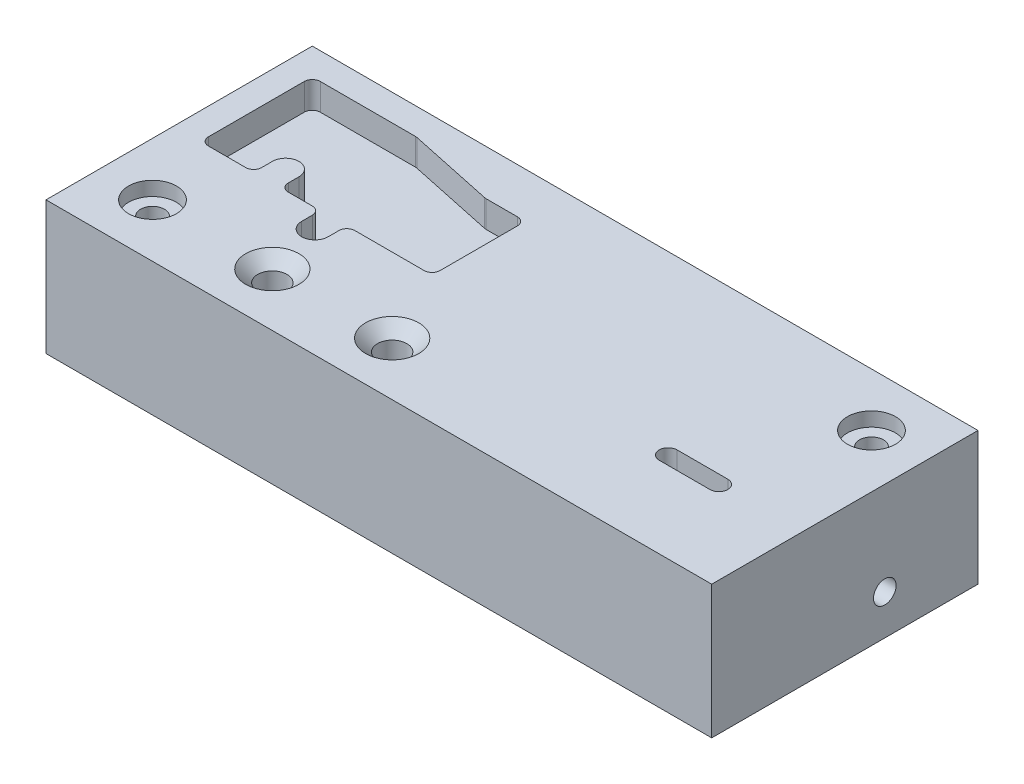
ISO-10303-21;
HEADER;
FILE_DESCRIPTION(('STEP AP214'),'2;1');
FILE_NAME('part.step','',(''),(''),'','','');
FILE_SCHEMA(('AUTOMOTIVE_DESIGN { 1 0 10303 214 1 1 1 1 }'));
ENDSEC;
DATA;
#1=APPLICATION_CONTEXT('core data for automotive mechanical design processes');
#2=APPLICATION_PROTOCOL_DEFINITION('international standard','automotive_design',2000,#1);
#3=PRODUCT_CONTEXT('',#1,'mechanical');
#4=PRODUCT('Part','Part','',(#3));
#5=PRODUCT_RELATED_PRODUCT_CATEGORY('part','',(#4));
#6=PRODUCT_DEFINITION_FORMATION('','',#4);
#7=PRODUCT_DEFINITION_CONTEXT('part definition',#1,'design');
#8=PRODUCT_DEFINITION('design','',#6,#7);
#9=PRODUCT_DEFINITION_SHAPE('','',#8);
#10=(LENGTH_UNIT() NAMED_UNIT(*) SI_UNIT(.MILLI.,.METRE.));
#11=(NAMED_UNIT(*) PLANE_ANGLE_UNIT() SI_UNIT($,.RADIAN.));
#12=(NAMED_UNIT(*) SI_UNIT($,.STERADIAN.) SOLID_ANGLE_UNIT());
#13=UNCERTAINTY_MEASURE_WITH_UNIT(LENGTH_MEASURE(1.E-05),#10,'distance_accuracy_value','');
#14=(GEOMETRIC_REPRESENTATION_CONTEXT(3) GLOBAL_UNCERTAINTY_ASSIGNED_CONTEXT((#13)) GLOBAL_UNIT_ASSIGNED_CONTEXT((#10,
#11,#12)) REPRESENTATION_CONTEXT('',''));
#15=CARTESIAN_POINT('',(0.,0.,0.));
#16=DIRECTION('',(0.,0.,1.));
#17=DIRECTION('',(1.,0.,0.));
#18=AXIS2_PLACEMENT_3D('',#15,#16,#17);
#19=CARTESIAN_POINT('',(-125.,50.,-50.));
#20=DIRECTION('',(1.,0.,0.));
#21=DIRECTION('',(0.,0.,-1.));
#22=AXIS2_PLACEMENT_3D('',#19,#20,#21);
#23=PLANE('',#22);
#24=DIRECTION('',(0.,0.,1.));
#25=VECTOR('',#24,1.);
#26=CARTESIAN_POINT('',(-125.,0.,-50.));
#27=LINE('',#26,#25);
#28=CARTESIAN_POINT('',(-125.,0.,-50.));
#29=VERTEX_POINT('',#28);
#30=CARTESIAN_POINT('',(-125.,0.,50.));
#31=VERTEX_POINT('',#30);
#32=EDGE_CURVE('E521',#29,#31,#27,.T.);
#33=ORIENTED_EDGE('',*,*,#32,.T.);
#34=DIRECTION('',(0.,-1.,0.));
#35=VECTOR('',#34,1.);
#36=CARTESIAN_POINT('',(-125.,50.,50.));
#37=LINE('',#36,#35);
#38=CARTESIAN_POINT('',(-125.,50.,50.));
#39=VERTEX_POINT('',#38);
#40=EDGE_CURVE('E11',#39,#31,#37,.T.);
#41=ORIENTED_EDGE('',*,*,#40,.F.);
#42=DIRECTION('',(0.,0.,1.));
#43=VECTOR('',#42,1.);
#44=CARTESIAN_POINT('',(-125.,50.,-50.));
#45=LINE('',#44,#43);
#46=CARTESIAN_POINT('',(-125.,50.,-50.));
#47=VERTEX_POINT('',#46);
#48=EDGE_CURVE('E522',#47,#39,#45,.T.);
#49=ORIENTED_EDGE('',*,*,#48,.F.);
#50=DIRECTION('',(0.,-1.,0.));
#51=VECTOR('',#50,1.);
#52=CARTESIAN_POINT('',(-125.,50.,-50.));
#53=LINE('',#52,#51);
#54=EDGE_CURVE('E532',#47,#29,#53,.T.);
#55=ORIENTED_EDGE('',*,*,#54,.T.);
#56=EDGE_LOOP('',(#33,#41,#49,#55));
#57=FACE_BOUND('',#56,.T.);
#58=ADVANCED_FACE('F36',(#57),#23,.F.);
#59=CARTESIAN_POINT('',(-125.,50.,50.));
#60=DIRECTION('',(0.,0.,-1.));
#61=DIRECTION('',(-1.,0.,0.));
#62=AXIS2_PLACEMENT_3D('',#59,#60,#61);
#63=PLANE('',#62);
#64=DIRECTION('',(1.,0.,0.));
#65=VECTOR('',#64,1.);
#66=CARTESIAN_POINT('',(-125.,0.,50.));
#67=LINE('',#66,#65);
#68=CARTESIAN_POINT('',(125.,0.,50.));
#69=VERTEX_POINT('',#68);
#70=EDGE_CURVE('E535',#31,#69,#67,.T.);
#71=ORIENTED_EDGE('',*,*,#70,.T.);
#72=DIRECTION('',(0.,-1.,0.));
#73=VECTOR('',#72,1.);
#74=CARTESIAN_POINT('',(125.,50.,50.));
#75=LINE('',#74,#73);
#76=CARTESIAN_POINT('',(125.,50.,50.));
#77=VERTEX_POINT('',#76);
#78=EDGE_CURVE('E43',#77,#69,#75,.T.);
#79=ORIENTED_EDGE('',*,*,#78,.F.);
#80=DIRECTION('',(1.,0.,0.));
#81=VECTOR('',#80,1.);
#82=CARTESIAN_POINT('',(-125.,50.,50.));
#83=LINE('',#82,#81);
#84=EDGE_CURVE('E525',#39,#77,#83,.T.);
#85=ORIENTED_EDGE('',*,*,#84,.F.);
#86=ORIENTED_EDGE('',*,*,#40,.T.);
#87=EDGE_LOOP('',(#71,#79,#85,#86));
#88=FACE_BOUND('',#87,.T.);
#89=ADVANCED_FACE('F564',(#88),#63,.F.);
#90=CARTESIAN_POINT('',(125.,50.,-50.));
#91=DIRECTION('',(-1.,0.,0.));
#92=DIRECTION('',(0.,0.,1.));
#93=AXIS2_PLACEMENT_3D('',#90,#91,#92);
#94=PLANE('',#93);
#95=CARTESIAN_POINT('',(125.,15.,-15.));
#96=DIRECTION('',(1.,0.,0.));
#97=DIRECTION('',(0.,0.,-1.));
#98=AXIS2_PLACEMENT_3D('',#95,#96,#97);
#99=CIRCLE('',#98,4.25);
#100=CARTESIAN_POINT('',(125.,15.,-19.25));
#101=VERTEX_POINT('',#100);
#102=EDGE_CURVE('E515',#101,#101,#99,.T.);
#103=ORIENTED_EDGE('',*,*,#102,.F.);
#104=EDGE_LOOP('',(#103));
#105=FACE_BOUND('',#104,.T.);
#106=DIRECTION('',(0.,0.,-1.));
#107=VECTOR('',#106,1.);
#108=CARTESIAN_POINT('',(125.,0.,-50.));
#109=LINE('',#108,#107);
#110=CARTESIAN_POINT('',(125.,0.,-50.));
#111=VERTEX_POINT('',#110);
#112=EDGE_CURVE('E537',#69,#111,#109,.T.);
#113=ORIENTED_EDGE('',*,*,#112,.T.);
#114=DIRECTION('',(0.,-1.,0.));
#115=VECTOR('',#114,1.);
#116=CARTESIAN_POINT('',(125.,50.,-50.));
#117=LINE('',#116,#115);
#118=CARTESIAN_POINT('',(125.,50.,-50.));
#119=VERTEX_POINT('',#118);
#120=EDGE_CURVE('E542',#119,#111,#117,.T.);
#121=ORIENTED_EDGE('',*,*,#120,.F.);
#122=DIRECTION('',(0.,0.,-1.));
#123=VECTOR('',#122,1.);
#124=CARTESIAN_POINT('',(125.,50.,-50.));
#125=LINE('',#124,#123);
#126=EDGE_CURVE('E528',#77,#119,#125,.T.);
#127=ORIENTED_EDGE('',*,*,#126,.F.);
#128=ORIENTED_EDGE('',*,*,#78,.T.);
#129=EDGE_LOOP('',(#113,#121,#127,#128));
#130=FACE_BOUND('',#129,.T.);
#131=ADVANCED_FACE('F549',(#105,#130),#94,.F.);
#132=CARTESIAN_POINT('',(-125.,50.,-50.));
#133=DIRECTION('',(0.,0.,1.));
#134=DIRECTION('',(1.,0.,0.));
#135=AXIS2_PLACEMENT_3D('',#132,#133,#134);
#136=PLANE('',#135);
#137=DIRECTION('',(-1.,0.,0.));
#138=VECTOR('',#137,1.);
#139=CARTESIAN_POINT('',(-125.,0.,-50.));
#140=LINE('',#139,#138);
#141=EDGE_CURVE('E526',#111,#29,#140,.T.);
#142=ORIENTED_EDGE('',*,*,#141,.T.);
#143=ORIENTED_EDGE('',*,*,#54,.F.);
#144=DIRECTION('',(-1.,0.,0.));
#145=VECTOR('',#144,1.);
#146=CARTESIAN_POINT('',(-125.,50.,-50.));
#147=LINE('',#146,#145);
#148=EDGE_CURVE('E530',#119,#47,#147,.T.);
#149=ORIENTED_EDGE('',*,*,#148,.F.);
#150=ORIENTED_EDGE('',*,*,#120,.T.);
#151=EDGE_LOOP('',(#142,#143,#149,#150));
#152=FACE_BOUND('',#151,.T.);
#153=ADVANCED_FACE('F557',(#152),#136,.F.);
#154=CARTESIAN_POINT('',(-125.,50.,50.));
#155=DIRECTION('',(0.,1.,0.));
#156=DIRECTION('',(0.,0.,1.));
#157=AXIS2_PLACEMENT_3D('',#154,#155,#156);
#158=PLANE('',#157);
#159=CARTESIAN_POINT('',(93.8768272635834,50.,16.1877978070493));
#160=DIRECTION('',(0.,1.,0.));
#161=DIRECTION('',(0.,0.,1.));
#162=AXIS2_PLACEMENT_3D('',#159,#160,#161);
#163=CIRCLE('',#162,3.36549999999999);
#164=CARTESIAN_POINT('',(93.8768272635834,50.,19.5532978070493));
#165=VERTEX_POINT('',#164);
#166=CARTESIAN_POINT('',(93.8768272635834,50.,12.8222978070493));
#167=VERTEX_POINT('',#166);
#168=EDGE_CURVE('E50',#165,#167,#163,.T.);
#169=ORIENTED_EDGE('',*,*,#168,.F.);
#170=DIRECTION('',(-1.,0.,0.));
#171=VECTOR('',#170,1.);
#172=CARTESIAN_POINT('',(93.8768272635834,50.,19.5532978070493));
#173=LINE('',#172,#171);
#174=CARTESIAN_POINT('',(74.8268272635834,50.,19.5532978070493));
#175=VERTEX_POINT('',#174);
#176=EDGE_CURVE('E263',#165,#175,#173,.T.);
#177=ORIENTED_EDGE('',*,*,#176,.T.);
#178=CARTESIAN_POINT('',(74.8268272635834,50.,16.1877978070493));
#179=DIRECTION('',(0.,-1.,0.));
#180=DIRECTION('',(0.,0.,-1.));
#181=AXIS2_PLACEMENT_3D('',#178,#179,#180);
#182=CIRCLE('',#181,3.36549999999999);
#183=CARTESIAN_POINT('',(74.8268272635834,50.,12.8222978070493));
#184=VERTEX_POINT('',#183);
#185=EDGE_CURVE('E266',#175,#184,#182,.T.);
#186=ORIENTED_EDGE('',*,*,#185,.T.);
#187=DIRECTION('',(1.,0.,0.));
#188=VECTOR('',#187,1.);
#189=CARTESIAN_POINT('',(74.8268272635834,50.,12.8222978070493));
#190=LINE('',#189,#188);
#191=EDGE_CURVE('E272',#184,#167,#190,.T.);
#192=ORIENTED_EDGE('',*,*,#191,.T.);
#193=EDGE_LOOP('',(#169,#177,#186,#192));
#194=FACE_BOUND('',#193,.T.);
#195=CARTESIAN_POINT('',(-15.,50.,30.));
#196=DIRECTION('',(0.,1.,0.));
#197=DIRECTION('',(0.,0.,1.));
#198=AXIS2_PLACEMENT_3D('',#195,#196,#197);
#199=CIRCLE('',#198,10.);
#200=CARTESIAN_POINT('',(-15.,50.,40.));
#201=VERTEX_POINT('',#200);
#202=EDGE_CURVE('E278',#201,#201,#199,.T.);
#203=ORIENTED_EDGE('',*,*,#202,.F.);
#204=EDGE_LOOP('',(#203));
#205=FACE_BOUND('',#204,.T.);
#206=CARTESIAN_POINT('',(-60.,50.,30.));
#207=DIRECTION('',(0.,1.,0.));
#208=DIRECTION('',(0.,0.,1.));
#209=AXIS2_PLACEMENT_3D('',#206,#207,#208);
#210=CIRCLE('',#209,10.);
#211=CARTESIAN_POINT('',(-60.,50.,40.));
#212=VERTEX_POINT('',#211);
#213=EDGE_CURVE('E290',#212,#212,#210,.T.);
#214=ORIENTED_EDGE('',*,*,#213,.F.);
#215=EDGE_LOOP('',(#214));
#216=FACE_BOUND('',#215,.T.);
#217=CARTESIAN_POINT('',(-31.,50.,-30.));
#218=DIRECTION('',(0.,1.,0.));
#219=DIRECTION('',(0.,0.,1.));
#220=AXIS2_PLACEMENT_3D('',#217,#218,#219);
#221=CIRCLE('',#220,3.);
#222=CARTESIAN_POINT('',(-28.,50.,-30.));
#223=VERTEX_POINT('',#222);
#224=CARTESIAN_POINT('',(-31.,50.,-33.));
#225=VERTEX_POINT('',#224);
#226=EDGE_CURVE('E299',#223,#225,#221,.T.);
#227=ORIENTED_EDGE('',*,*,#226,.F.);
#228=DIRECTION('',(0.,0.,-1.));
#229=VECTOR('',#228,1.);
#230=CARTESIAN_POINT('',(-28.,50.,-30.));
#231=LINE('',#230,#229);
#232=CARTESIAN_POINT('',(-28.,50.,-0.999999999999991));
#233=VERTEX_POINT('',#232);
#234=EDGE_CURVE('E304',#233,#223,#231,.T.);
#235=ORIENTED_EDGE('',*,*,#234,.F.);
#236=CARTESIAN_POINT('',(-31.,50.,-0.99999999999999));
#237=DIRECTION('',(0.,1.,0.));
#238=DIRECTION('',(0.,0.,1.));
#239=AXIS2_PLACEMENT_3D('',#236,#237,#238);
#240=CIRCLE('',#239,3.);
#241=CARTESIAN_POINT('',(-31.,50.,2.00000000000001));
#242=VERTEX_POINT('',#241);
#243=EDGE_CURVE('E438',#242,#233,#240,.T.);
#244=ORIENTED_EDGE('',*,*,#243,.F.);
#245=DIRECTION('',(1.,0.,0.));
#246=VECTOR('',#245,1.);
#247=CARTESIAN_POINT('',(-57.,50.,2.00000000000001));
#248=LINE('',#247,#246);
#249=CARTESIAN_POINT('',(-57.,50.,2.00000000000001));
#250=VERTEX_POINT('',#249);
#251=EDGE_CURVE('E435',#250,#242,#248,.T.);
#252=ORIENTED_EDGE('',*,*,#251,.F.);
#253=CARTESIAN_POINT('',(-57.,50.,5.00000000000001));
#254=DIRECTION('',(0.,-1.,0.));
#255=DIRECTION('',(0.,0.,-1.));
#256=AXIS2_PLACEMENT_3D('',#253,#254,#255);
#257=CIRCLE('',#256,3.);
#258=CARTESIAN_POINT('',(-60.,50.,5.00000000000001));
#259=VERTEX_POINT('',#258);
#260=EDGE_CURVE('E432',#259,#250,#257,.T.);
#261=ORIENTED_EDGE('',*,*,#260,.F.);
#262=DIRECTION('',(0.,0.,-1.));
#263=VECTOR('',#262,1.);
#264=CARTESIAN_POINT('',(-60.,50.,9.00000000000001));
#265=LINE('',#264,#263);
#266=CARTESIAN_POINT('',(-60.,50.,9.00000000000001));
#267=VERTEX_POINT('',#266);
#268=EDGE_CURVE('E429',#267,#259,#265,.T.);
#269=ORIENTED_EDGE('',*,*,#268,.F.);
#270=CARTESIAN_POINT('',(-65.,50.,9.00000000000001));
#271=DIRECTION('',(0.,1.,0.));
#272=DIRECTION('',(0.,0.,1.));
#273=AXIS2_PLACEMENT_3D('',#270,#271,#272);
#274=CIRCLE('',#273,5.00000000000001);
#275=CARTESIAN_POINT('',(-70.,50.,9.00000000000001));
#276=VERTEX_POINT('',#275);
#277=EDGE_CURVE('E426',#276,#267,#274,.T.);
#278=ORIENTED_EDGE('',*,*,#277,.F.);
#279=DIRECTION('',(0.,0.,1.));
#280=VECTOR('',#279,1.);
#281=CARTESIAN_POINT('',(-70.,50.,5.00000000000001));
#282=LINE('',#281,#280);
#283=CARTESIAN_POINT('',(-70.,50.,5.00000000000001));
#284=VERTEX_POINT('',#283);
#285=EDGE_CURVE('E423',#284,#276,#282,.T.);
#286=ORIENTED_EDGE('',*,*,#285,.F.);
#287=CARTESIAN_POINT('',(-73.,50.,5.00000000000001));
#288=DIRECTION('',(0.,-1.,0.));
#289=DIRECTION('',(0.,0.,1.));
#290=AXIS2_PLACEMENT_3D('',#287,#288,#289);
#291=CIRCLE('',#290,3.);
#292=CARTESIAN_POINT('',(-73.,50.,2.00000000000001));
#293=VERTEX_POINT('',#292);
#294=EDGE_CURVE('E420',#293,#284,#291,.T.);
#295=ORIENTED_EDGE('',*,*,#294,.F.);
#296=DIRECTION('',(1.,0.,0.));
#297=VECTOR('',#296,1.);
#298=CARTESIAN_POINT('',(-82.,50.,2.00000000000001));
#299=LINE('',#298,#297);
#300=CARTESIAN_POINT('',(-82.,50.,2.00000000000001));
#301=VERTEX_POINT('',#300);
#302=EDGE_CURVE('E417',#301,#293,#299,.T.);
#303=ORIENTED_EDGE('',*,*,#302,.F.);
#304=CARTESIAN_POINT('',(-82.,50.,-0.999999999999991));
#305=DIRECTION('',(0.,1.,0.));
#306=DIRECTION('',(0.,0.,1.));
#307=AXIS2_PLACEMENT_3D('',#304,#305,#306);
#308=CIRCLE('',#307,2.99999999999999);
#309=CARTESIAN_POINT('',(-85.,50.,-0.999999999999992));
#310=VERTEX_POINT('',#309);
#311=EDGE_CURVE('E414',#310,#301,#308,.T.);
#312=ORIENTED_EDGE('',*,*,#311,.F.);
#313=DIRECTION('',(0.,0.,1.));
#314=VECTOR('',#313,1.);
#315=CARTESIAN_POINT('',(-85.,50.,-4.99999999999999));
#316=LINE('',#315,#314);
#317=CARTESIAN_POINT('',(-85.,50.,-4.99999999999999));
#318=VERTEX_POINT('',#317);
#319=EDGE_CURVE('E411',#318,#310,#316,.T.);
#320=ORIENTED_EDGE('',*,*,#319,.F.);
#321=CARTESIAN_POINT('',(-90.,50.,-4.99999999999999));
#322=DIRECTION('',(0.,-1.,0.));
#323=DIRECTION('',(0.,0.,-1.));
#324=AXIS2_PLACEMENT_3D('',#321,#322,#323);
#325=CIRCLE('',#324,5.);
#326=CARTESIAN_POINT('',(-95.,50.,-4.99999999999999));
#327=VERTEX_POINT('',#326);
#328=EDGE_CURVE('E408',#327,#318,#325,.T.);
#329=ORIENTED_EDGE('',*,*,#328,.F.);
#330=DIRECTION('',(0.,0.,-1.));
#331=VECTOR('',#330,1.);
#332=CARTESIAN_POINT('',(-95.,50.,-0.999999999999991));
#333=LINE('',#332,#331);
#334=CARTESIAN_POINT('',(-95.,50.,-0.999999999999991));
#335=VERTEX_POINT('',#334);
#336=EDGE_CURVE('E405',#335,#327,#333,.T.);
#337=ORIENTED_EDGE('',*,*,#336,.F.);
#338=CARTESIAN_POINT('',(-98.,50.,-0.999999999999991));
#339=DIRECTION('',(0.,1.,0.));
#340=DIRECTION('',(0.,0.,-1.));
#341=AXIS2_PLACEMENT_3D('',#338,#339,#340);
#342=CIRCLE('',#341,3.);
#343=CARTESIAN_POINT('',(-98.,50.,2.00000000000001));
#344=VERTEX_POINT('',#343);
#345=EDGE_CURVE('E402',#344,#335,#342,.T.);
#346=ORIENTED_EDGE('',*,*,#345,.F.);
#347=DIRECTION('',(1.,0.,0.));
#348=VECTOR('',#347,1.);
#349=CARTESIAN_POINT('',(-112.,50.,2.00000000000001));
#350=LINE('',#349,#348);
#351=CARTESIAN_POINT('',(-112.,50.,2.00000000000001));
#352=VERTEX_POINT('',#351);
#353=EDGE_CURVE('E399',#352,#344,#350,.T.);
#354=ORIENTED_EDGE('',*,*,#353,.F.);
#355=CARTESIAN_POINT('',(-112.,50.,-0.999999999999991));
#356=DIRECTION('',(0.,1.,0.));
#357=DIRECTION('',(0.,0.,1.));
#358=AXIS2_PLACEMENT_3D('',#355,#356,#357);
#359=CIRCLE('',#358,3.00000000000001);
#360=CARTESIAN_POINT('',(-115.,50.,-0.999999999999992));
#361=VERTEX_POINT('',#360);
#362=EDGE_CURVE('E396',#361,#352,#359,.T.);
#363=ORIENTED_EDGE('',*,*,#362,.F.);
#364=DIRECTION('',(0.,0.,1.));
#365=VECTOR('',#364,1.);
#366=CARTESIAN_POINT('',(-115.,50.,-37.));
#367=LINE('',#366,#365);
#368=CARTESIAN_POINT('',(-115.,50.,-37.));
#369=VERTEX_POINT('',#368);
#370=EDGE_CURVE('E393',#369,#361,#367,.T.);
#371=ORIENTED_EDGE('',*,*,#370,.F.);
#372=CARTESIAN_POINT('',(-112.,50.,-37.));
#373=DIRECTION('',(0.,1.,0.));
#374=DIRECTION('',(0.,0.,1.));
#375=AXIS2_PLACEMENT_3D('',#372,#373,#374);
#376=CIRCLE('',#375,3.00000000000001);
#377=CARTESIAN_POINT('',(-112.,50.,-40.));
#378=VERTEX_POINT('',#377);
#379=EDGE_CURVE('E390',#378,#369,#376,.T.);
#380=ORIENTED_EDGE('',*,*,#379,.F.);
#381=DIRECTION('',(-1.,0.,0.));
#382=VECTOR('',#381,1.);
#383=CARTESIAN_POINT('',(-112.,50.,-40.));
#384=LINE('',#383,#382);
#385=CARTESIAN_POINT('',(-76.2477234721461,50.,-40.));
#386=VERTEX_POINT('',#385);
#387=EDGE_CURVE('E387',#386,#378,#384,.T.);
#388=ORIENTED_EDGE('',*,*,#387,.F.);
#389=CARTESIAN_POINT('',(-76.2477234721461,50.,-37.));
#390=DIRECTION('',(0.,1.,0.));
#391=DIRECTION('',(0.,0.,1.));
#392=AXIS2_PLACEMENT_3D('',#389,#390,#391);
#393=CIRCLE('',#392,3.00000000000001);
#394=CARTESIAN_POINT('',(-75.6239883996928,50.,-39.9344428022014));
#395=VERTEX_POINT('',#394);
#396=EDGE_CURVE('E384',#395,#386,#393,.T.);
#397=ORIENTED_EDGE('',*,*,#396,.F.);
#398=DIRECTION('',(-0.978147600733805,0.,-0.20791169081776));
#399=VECTOR('',#398,1.);
#400=CARTESIAN_POINT('',(-75.6239883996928,50.,-39.9344428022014));
#401=LINE('',#400,#399);
#402=CARTESIAN_POINT('',(-43.3084223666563,50.,-33.0655571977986));
#403=VERTEX_POINT('',#402);
#404=EDGE_CURVE('E381',#403,#395,#401,.T.);
#405=ORIENTED_EDGE('',*,*,#404,.F.);
#406=CARTESIAN_POINT('',(-42.684687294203,50.,-36.));
#407=DIRECTION('',(0.,-1.,0.));
#408=DIRECTION('',(0.,0.,1.));
#409=AXIS2_PLACEMENT_3D('',#406,#407,#408);
#410=CIRCLE('',#409,3.00000000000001);
#411=CARTESIAN_POINT('',(-42.684687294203,50.,-33.));
#412=VERTEX_POINT('',#411);
#413=EDGE_CURVE('E378',#412,#403,#410,.T.);
#414=ORIENTED_EDGE('',*,*,#413,.F.);
#415=DIRECTION('',(-1.,0.,0.));
#416=VECTOR('',#415,1.);
#417=CARTESIAN_POINT('',(-42.684687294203,50.,-33.));
#418=LINE('',#417,#416);
#419=EDGE_CURVE('E375',#225,#412,#418,.T.);
#420=ORIENTED_EDGE('',*,*,#419,.F.);
#421=EDGE_LOOP('',(#227,#235,#244,#252,#261,#269,#278,#286,#295,#303,#312,#320,#329,#337,#346,
#354,#363,#371,#380,#388,#397,#405,#414,#420));
#422=FACE_BOUND('',#421,.T.);
#423=CARTESIAN_POINT('',(-105.,50.,30.));
#424=DIRECTION('',(0.,1.,0.));
#425=DIRECTION('',(0.,0.,1.));
#426=AXIS2_PLACEMENT_3D('',#423,#424,#425);
#427=CIRCLE('',#426,9.0055);
#428=CARTESIAN_POINT('',(-105.,50.,39.0055));
#429=VERTEX_POINT('',#428);
#430=EDGE_CURVE('E445',#429,#429,#427,.T.);
#431=ORIENTED_EDGE('',*,*,#430,.F.);
#432=EDGE_LOOP('',(#431));
#433=FACE_BOUND('',#432,.T.);
#434=CARTESIAN_POINT('',(105.,50.,-30.));
#435=DIRECTION('',(0.,1.,0.));
#436=DIRECTION('',(0.,0.,1.));
#437=AXIS2_PLACEMENT_3D('',#434,#435,#436);
#438=CIRCLE('',#437,9.0055);
#439=CARTESIAN_POINT('',(105.,50.,-20.9945));
#440=VERTEX_POINT('',#439);
#441=EDGE_CURVE('E503',#440,#440,#438,.T.);
#442=ORIENTED_EDGE('',*,*,#441,.F.);
#443=EDGE_LOOP('',(#442));
#444=FACE_BOUND('',#443,.T.);
#445=ORIENTED_EDGE('',*,*,#48,.T.);
#446=ORIENTED_EDGE('',*,*,#84,.T.);
#447=ORIENTED_EDGE('',*,*,#126,.T.);
#448=ORIENTED_EDGE('',*,*,#148,.T.);
#449=EDGE_LOOP('',(#445,#446,#447,#448));
#450=FACE_BOUND('',#449,.T.);
#451=ADVANCED_FACE('F563',(#194,#205,#216,#422,#433,#444,#450),#158,.T.);
#452=CARTESIAN_POINT('',(-125.,0.,50.));
#453=DIRECTION('',(0.,1.,0.));
#454=DIRECTION('',(0.,0.,1.));
#455=AXIS2_PLACEMENT_3D('',#452,#453,#454);
#456=PLANE('',#455);
#457=DIRECTION('',(-1.,0.,0.));
#458=VECTOR('',#457,1.);
#459=CARTESIAN_POINT('',(93.8768272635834,0.,19.5532978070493));
#460=LINE('',#459,#458);
#461=CARTESIAN_POINT('',(93.8768272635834,0.,19.5532978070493));
#462=VERTEX_POINT('',#461);
#463=CARTESIAN_POINT('',(74.8268272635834,0.,19.5532978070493));
#464=VERTEX_POINT('',#463);
#465=EDGE_CURVE('E259',#462,#464,#460,.T.);
#466=ORIENTED_EDGE('',*,*,#465,.F.);
#467=CARTESIAN_POINT('',(93.8768272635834,0.,16.1877978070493));
#468=DIRECTION('',(0.,1.,0.));
#469=DIRECTION('',(0.,0.,1.));
#470=AXIS2_PLACEMENT_3D('',#467,#468,#469);
#471=CIRCLE('',#470,3.36549999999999);
#472=CARTESIAN_POINT('',(93.8768272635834,0.,12.8222978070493));
#473=VERTEX_POINT('',#472);
#474=EDGE_CURVE('E254',#462,#473,#471,.T.);
#475=ORIENTED_EDGE('',*,*,#474,.T.);
#476=DIRECTION('',(1.,0.,0.));
#477=VECTOR('',#476,1.);
#478=CARTESIAN_POINT('',(74.8268272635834,0.,12.8222978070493));
#479=LINE('',#478,#477);
#480=CARTESIAN_POINT('',(74.8268272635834,0.,12.8222978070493));
#481=VERTEX_POINT('',#480);
#482=EDGE_CURVE('E246',#481,#473,#479,.T.);
#483=ORIENTED_EDGE('',*,*,#482,.F.);
#484=CARTESIAN_POINT('',(74.8268272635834,0.,16.1877978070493));
#485=DIRECTION('',(0.,-1.,0.));
#486=DIRECTION('',(0.,0.,-1.));
#487=AXIS2_PLACEMENT_3D('',#484,#485,#486);
#488=CIRCLE('',#487,3.36549999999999);
#489=EDGE_CURVE('E253',#464,#481,#488,.T.);
#490=ORIENTED_EDGE('',*,*,#489,.F.);
#491=EDGE_LOOP('',(#466,#475,#483,#490));
#492=FACE_BOUND('',#491,.T.);
#493=CARTESIAN_POINT('',(-15.,0.,30.));
#494=DIRECTION('',(0.,1.,0.));
#495=DIRECTION('',(0.,0.,1.));
#496=AXIS2_PLACEMENT_3D('',#493,#494,#495);
#497=CIRCLE('',#496,5.49999999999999);
#498=CARTESIAN_POINT('',(-15.,0.,35.5));
#499=VERTEX_POINT('',#498);
#500=EDGE_CURVE('E287',#499,#499,#497,.T.);
#501=ORIENTED_EDGE('',*,*,#500,.T.);
#502=EDGE_LOOP('',(#501));
#503=FACE_BOUND('',#502,.T.);
#504=CARTESIAN_POINT('',(-60.,0.,30.));
#505=DIRECTION('',(0.,1.,0.));
#506=DIRECTION('',(0.,0.,1.));
#507=AXIS2_PLACEMENT_3D('',#504,#505,#506);
#508=CIRCLE('',#507,5.49999999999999);
#509=CARTESIAN_POINT('',(-60.,0.,35.5));
#510=VERTEX_POINT('',#509);
#511=EDGE_CURVE('E296',#510,#510,#508,.T.);
#512=ORIENTED_EDGE('',*,*,#511,.T.);
#513=EDGE_LOOP('',(#512));
#514=FACE_BOUND('',#513,.T.);
#515=CARTESIAN_POINT('',(-105.,0.,30.));
#516=DIRECTION('',(0.,1.,0.));
#517=DIRECTION('',(0.,0.,1.));
#518=AXIS2_PLACEMENT_3D('',#515,#516,#517);
#519=CIRCLE('',#518,4.49999999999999);
#520=CARTESIAN_POINT('',(-105.,0.,34.5));
#521=VERTEX_POINT('',#520);
#522=EDGE_CURVE('E500',#521,#521,#519,.T.);
#523=ORIENTED_EDGE('',*,*,#522,.T.);
#524=EDGE_LOOP('',(#523));
#525=FACE_BOUND('',#524,.T.);
#526=CARTESIAN_POINT('',(105.,0.,-30.));
#527=DIRECTION('',(0.,1.,0.));
#528=DIRECTION('',(0.,0.,1.));
#529=AXIS2_PLACEMENT_3D('',#526,#527,#528);
#530=CIRCLE('',#529,4.49999999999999);
#531=CARTESIAN_POINT('',(105.,0.,-25.5));
#532=VERTEX_POINT('',#531);
#533=EDGE_CURVE('E512',#532,#532,#530,.T.);
#534=ORIENTED_EDGE('',*,*,#533,.T.);
#535=EDGE_LOOP('',(#534));
#536=FACE_BOUND('',#535,.T.);
#537=ORIENTED_EDGE('',*,*,#32,.F.);
#538=ORIENTED_EDGE('',*,*,#141,.F.);
#539=ORIENTED_EDGE('',*,*,#112,.F.);
#540=ORIENTED_EDGE('',*,*,#70,.F.);
#541=EDGE_LOOP('',(#537,#538,#539,#540));
#542=FACE_BOUND('',#541,.T.);
#543=ADVANCED_FACE('F261',(#492,#503,#514,#525,#536,#542),#456,.F.);
#544=CARTESIAN_POINT('',(100.,15.,-15.));
#545=DIRECTION('',(1.,0.,0.));
#546=DIRECTION('',(0.,0.,-1.));
#547=AXIS2_PLACEMENT_3D('',#544,#545,#546);
#548=CONICAL_SURFACE('',#547,4.25,1.02974425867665);
#549=CARTESIAN_POINT('',(97.4463423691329,15.,-15.));
#550=VERTEX_POINT('',#549);
#551=VERTEX_LOOP('',#550);
#552=FACE_BOUND('',#551,.T.);
#553=CARTESIAN_POINT('',(100.,15.,-15.));
#554=DIRECTION('',(1.,0.,0.));
#555=DIRECTION('',(0.,0.,-1.));
#556=AXIS2_PLACEMENT_3D('',#553,#554,#555);
#557=CIRCLE('',#556,4.25);
#558=CARTESIAN_POINT('',(100.,15.,-19.25));
#559=VERTEX_POINT('',#558);
#560=EDGE_CURVE('E518',#559,#559,#557,.T.);
#561=ORIENTED_EDGE('',*,*,#560,.T.);
#562=EDGE_LOOP('',(#561));
#563=FACE_BOUND('',#562,.T.);
#564=ADVANCED_FACE('F577',(#552,#563),#548,.F.);
#565=CARTESIAN_POINT('',(125.,15.,-15.));
#566=DIRECTION('',(1.,0.,0.));
#567=DIRECTION('',(0.,0.,-1.));
#568=AXIS2_PLACEMENT_3D('',#565,#566,#567);
#569=CYLINDRICAL_SURFACE('',#568,4.25);
#570=ORIENTED_EDGE('',*,*,#560,.F.);
#571=EDGE_LOOP('',(#570));
#572=FACE_BOUND('',#571,.T.);
#573=ORIENTED_EDGE('',*,*,#102,.T.);
#574=EDGE_LOOP('',(#573));
#575=FACE_BOUND('',#574,.T.);
#576=ADVANCED_FACE('F583',(#572,#575),#569,.F.);
#577=CARTESIAN_POINT('',(105.,50.,-30.));
#578=DIRECTION('',(0.,1.,0.));
#579=DIRECTION('',(0.,0.,1.));
#580=AXIS2_PLACEMENT_3D('',#577,#578,#579);
#581=CYLINDRICAL_SURFACE('',#580,4.5);
#582=ORIENTED_EDGE('',*,*,#533,.F.);
#583=EDGE_LOOP('',(#582));
#584=FACE_BOUND('',#583,.T.);
#585=CARTESIAN_POINT('',(105.,44.7,-30.));
#586=DIRECTION('',(0.,1.,0.));
#587=DIRECTION('',(0.,0.,1.));
#588=AXIS2_PLACEMENT_3D('',#585,#586,#587);
#589=CIRCLE('',#588,4.5);
#590=CARTESIAN_POINT('',(105.,44.7,-25.5));
#591=VERTEX_POINT('',#590);
#592=EDGE_CURVE('E509',#591,#591,#589,.T.);
#593=ORIENTED_EDGE('',*,*,#592,.T.);
#594=EDGE_LOOP('',(#593));
#595=FACE_BOUND('',#594,.T.);
#596=ADVANCED_FACE('F587',(#584,#595),#581,.F.);
#597=CARTESIAN_POINT('',(109.5,44.7,-30.));
#598=DIRECTION('',(0.,-1.,0.));
#599=DIRECTION('',(0.,0.,-1.));
#600=AXIS2_PLACEMENT_3D('',#597,#598,#599);
#601=PLANE('',#600);
#602=ORIENTED_EDGE('',*,*,#592,.F.);
#603=EDGE_LOOP('',(#602));
#604=FACE_BOUND('',#603,.T.);
#605=CARTESIAN_POINT('',(105.,44.7,-30.));
#606=DIRECTION('',(0.,1.,0.));
#607=DIRECTION('',(0.,0.,1.));
#608=AXIS2_PLACEMENT_3D('',#605,#606,#607);
#609=CIRCLE('',#608,9.0055);
#610=CARTESIAN_POINT('',(105.,44.7,-20.9945));
#611=VERTEX_POINT('',#610);
#612=EDGE_CURVE('E506',#611,#611,#609,.T.);
#613=ORIENTED_EDGE('',*,*,#612,.T.);
#614=EDGE_LOOP('',(#613));
#615=FACE_BOUND('',#614,.T.);
#616=ADVANCED_FACE('F591',(#604,#615),#601,.F.);
#617=CARTESIAN_POINT('',(105.,50.,-30.));
#618=DIRECTION('',(0.,1.,0.));
#619=DIRECTION('',(0.,0.,1.));
#620=AXIS2_PLACEMENT_3D('',#617,#618,#619);
#621=CYLINDRICAL_SURFACE('',#620,9.0055);
#622=ORIENTED_EDGE('',*,*,#612,.F.);
#623=EDGE_LOOP('',(#622));
#624=FACE_BOUND('',#623,.T.);
#625=ORIENTED_EDGE('',*,*,#441,.T.);
#626=EDGE_LOOP('',(#625));
#627=FACE_BOUND('',#626,.T.);
#628=ADVANCED_FACE('F595',(#624,#627),#621,.F.);
#629=CARTESIAN_POINT('',(-105.,50.,30.));
#630=DIRECTION('',(0.,1.,0.));
#631=DIRECTION('',(0.,0.,1.));
#632=AXIS2_PLACEMENT_3D('',#629,#630,#631);
#633=CYLINDRICAL_SURFACE('',#632,4.5);
#634=ORIENTED_EDGE('',*,*,#522,.F.);
#635=EDGE_LOOP('',(#634));
#636=FACE_BOUND('',#635,.T.);
#637=CARTESIAN_POINT('',(-105.,44.7,30.));
#638=DIRECTION('',(0.,1.,0.));
#639=DIRECTION('',(0.,0.,1.));
#640=AXIS2_PLACEMENT_3D('',#637,#638,#639);
#641=CIRCLE('',#640,4.5);
#642=CARTESIAN_POINT('',(-105.,44.7,34.5));
#643=VERTEX_POINT('',#642);
#644=EDGE_CURVE('E497',#643,#643,#641,.T.);
#645=ORIENTED_EDGE('',*,*,#644,.T.);
#646=EDGE_LOOP('',(#645));
#647=FACE_BOUND('',#646,.T.);
#648=ADVANCED_FACE('F599',(#636,#647),#633,.F.);
#649=CARTESIAN_POINT('',(-100.5,44.7,30.));
#650=DIRECTION('',(0.,-1.,0.));
#651=DIRECTION('',(0.,0.,-1.));
#652=AXIS2_PLACEMENT_3D('',#649,#650,#651);
#653=PLANE('',#652);
#654=ORIENTED_EDGE('',*,*,#644,.F.);
#655=EDGE_LOOP('',(#654));
#656=FACE_BOUND('',#655,.T.);
#657=CARTESIAN_POINT('',(-105.,44.7,30.));
#658=DIRECTION('',(0.,1.,0.));
#659=DIRECTION('',(0.,0.,1.));
#660=AXIS2_PLACEMENT_3D('',#657,#658,#659);
#661=CIRCLE('',#660,9.0055);
#662=CARTESIAN_POINT('',(-105.,44.7,39.0055));
#663=VERTEX_POINT('',#662);
#664=EDGE_CURVE('E494',#663,#663,#661,.T.);
#665=ORIENTED_EDGE('',*,*,#664,.T.);
#666=EDGE_LOOP('',(#665));
#667=FACE_BOUND('',#666,.T.);
#668=ADVANCED_FACE('F603',(#656,#667),#653,.F.);
#669=CARTESIAN_POINT('',(-105.,50.,30.));
#670=DIRECTION('',(0.,1.,0.));
#671=DIRECTION('',(0.,0.,1.));
#672=AXIS2_PLACEMENT_3D('',#669,#670,#671);
#673=CYLINDRICAL_SURFACE('',#672,9.0055);
#674=ORIENTED_EDGE('',*,*,#664,.F.);
#675=EDGE_LOOP('',(#674));
#676=FACE_BOUND('',#675,.T.);
#677=ORIENTED_EDGE('',*,*,#430,.T.);
#678=EDGE_LOOP('',(#677));
#679=FACE_BOUND('',#678,.T.);
#680=ADVANCED_FACE('F607',(#676,#679),#673,.F.);
#681=CARTESIAN_POINT('',(-31.,40.,-30.));
#682=DIRECTION('',(0.,1.,0.));
#683=DIRECTION('',(0.,0.,1.));
#684=AXIS2_PLACEMENT_3D('',#681,#682,#683);
#685=CYLINDRICAL_SURFACE('',#684,3.);
#686=ORIENTED_EDGE('',*,*,#226,.T.);
#687=DIRECTION('',(0.,1.,0.));
#688=VECTOR('',#687,1.);
#689=CARTESIAN_POINT('',(-31.,40.,-33.));
#690=LINE('',#689,#688);
#691=CARTESIAN_POINT('',(-31.,40.,-33.));
#692=VERTEX_POINT('',#691);
#693=EDGE_CURVE('E373',#692,#225,#690,.T.);
#694=ORIENTED_EDGE('',*,*,#693,.F.);
#695=CARTESIAN_POINT('',(-31.,40.,-30.));
#696=DIRECTION('',(0.,1.,0.));
#697=DIRECTION('',(0.,0.,1.));
#698=AXIS2_PLACEMENT_3D('',#695,#696,#697);
#699=CIRCLE('',#698,3.);
#700=CARTESIAN_POINT('',(-28.,40.,-30.));
#701=VERTEX_POINT('',#700);
#702=EDGE_CURVE('E300',#701,#692,#699,.T.);
#703=ORIENTED_EDGE('',*,*,#702,.F.);
#704=DIRECTION('',(0.,1.,0.));
#705=VECTOR('',#704,1.);
#706=CARTESIAN_POINT('',(-28.,40.,-30.));
#707=LINE('',#706,#705);
#708=EDGE_CURVE('E443',#701,#223,#707,.T.);
#709=ORIENTED_EDGE('',*,*,#708,.T.);
#710=EDGE_LOOP('',(#686,#694,#703,#709));
#711=FACE_BOUND('',#710,.T.);
#712=ADVANCED_FACE('F611',(#711),#685,.F.);
#713=CARTESIAN_POINT('',(-28.,40.,-30.));
#714=DIRECTION('',(1.,0.,0.));
#715=DIRECTION('',(0.,0.,-1.));
#716=AXIS2_PLACEMENT_3D('',#713,#714,#715);
#717=PLANE('',#716);
#718=ORIENTED_EDGE('',*,*,#234,.T.);
#719=ORIENTED_EDGE('',*,*,#708,.F.);
#720=DIRECTION('',(0.,0.,-1.));
#721=VECTOR('',#720,1.);
#722=CARTESIAN_POINT('',(-28.,40.,-30.));
#723=LINE('',#722,#721);
#724=CARTESIAN_POINT('',(-28.,40.,-0.999999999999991));
#725=VERTEX_POINT('',#724);
#726=EDGE_CURVE('E370',#725,#701,#723,.T.);
#727=ORIENTED_EDGE('',*,*,#726,.F.);
#728=DIRECTION('',(0.,1.,0.));
#729=VECTOR('',#728,1.);
#730=CARTESIAN_POINT('',(-28.,40.,-0.999999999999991));
#731=LINE('',#730,#729);
#732=EDGE_CURVE('E446',#725,#233,#731,.T.);
#733=ORIENTED_EDGE('',*,*,#732,.T.);
#734=EDGE_LOOP('',(#718,#719,#727,#733));
#735=FACE_BOUND('',#734,.T.);
#736=ADVANCED_FACE('F615',(#735),#717,.F.);
#737=CARTESIAN_POINT('',(-31.,40.,-0.99999999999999));
#738=DIRECTION('',(0.,1.,0.));
#739=DIRECTION('',(0.,0.,1.));
#740=AXIS2_PLACEMENT_3D('',#737,#738,#739);
#741=CYLINDRICAL_SURFACE('',#740,3.);
#742=ORIENTED_EDGE('',*,*,#243,.T.);
#743=ORIENTED_EDGE('',*,*,#732,.F.);
#744=CARTESIAN_POINT('',(-31.,40.,-0.99999999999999));
#745=DIRECTION('',(0.,1.,0.));
#746=DIRECTION('',(0.,0.,1.));
#747=AXIS2_PLACEMENT_3D('',#744,#745,#746);
#748=CIRCLE('',#747,3.);
#749=CARTESIAN_POINT('',(-31.,40.,2.00000000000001));
#750=VERTEX_POINT('',#749);
#751=EDGE_CURVE('E367',#750,#725,#748,.T.);
#752=ORIENTED_EDGE('',*,*,#751,.F.);
#753=DIRECTION('',(0.,1.,0.));
#754=VECTOR('',#753,1.);
#755=CARTESIAN_POINT('',(-31.,40.,2.00000000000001));
#756=LINE('',#755,#754);
#757=EDGE_CURVE('E448',#750,#242,#756,.T.);
#758=ORIENTED_EDGE('',*,*,#757,.T.);
#759=EDGE_LOOP('',(#742,#743,#752,#758));
#760=FACE_BOUND('',#759,.T.);
#761=ADVANCED_FACE('F701',(#760),#741,.F.);
#762=CARTESIAN_POINT('',(-57.,40.,2.00000000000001));
#763=DIRECTION('',(0.,0.,1.));
#764=DIRECTION('',(1.,0.,0.));
#765=AXIS2_PLACEMENT_3D('',#762,#763,#764);
#766=PLANE('',#765);
#767=ORIENTED_EDGE('',*,*,#251,.T.);
#768=ORIENTED_EDGE('',*,*,#757,.F.);
#769=DIRECTION('',(1.,0.,0.));
#770=VECTOR('',#769,1.);
#771=CARTESIAN_POINT('',(-57.,40.,2.00000000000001));
#772=LINE('',#771,#770);
#773=CARTESIAN_POINT('',(-57.,40.,2.00000000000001));
#774=VERTEX_POINT('',#773);
#775=EDGE_CURVE('E364',#774,#750,#772,.T.);
#776=ORIENTED_EDGE('',*,*,#775,.F.);
#777=DIRECTION('',(0.,1.,0.));
#778=VECTOR('',#777,1.);
#779=CARTESIAN_POINT('',(-57.,40.,2.00000000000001));
#780=LINE('',#779,#778);
#781=EDGE_CURVE('E450',#774,#250,#780,.T.);
#782=ORIENTED_EDGE('',*,*,#781,.T.);
#783=EDGE_LOOP('',(#767,#768,#776,#782));
#784=FACE_BOUND('',#783,.T.);
#785=ADVANCED_FACE('F697',(#784),#766,.F.);
#786=CARTESIAN_POINT('',(-57.,40.,5.00000000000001));
#787=DIRECTION('',(0.,1.,0.));
#788=DIRECTION('',(0.,0.,1.));
#789=AXIS2_PLACEMENT_3D('',#786,#787,#788);
#790=CYLINDRICAL_SURFACE('',#789,3.);
#791=ORIENTED_EDGE('',*,*,#260,.T.);
#792=ORIENTED_EDGE('',*,*,#781,.F.);
#793=CARTESIAN_POINT('',(-57.,40.,5.00000000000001));
#794=DIRECTION('',(0.,-1.,0.));
#795=DIRECTION('',(0.,0.,-1.));
#796=AXIS2_PLACEMENT_3D('',#793,#794,#795);
#797=CIRCLE('',#796,3.);
#798=CARTESIAN_POINT('',(-60.,40.,5.00000000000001));
#799=VERTEX_POINT('',#798);
#800=EDGE_CURVE('E361',#799,#774,#797,.T.);
#801=ORIENTED_EDGE('',*,*,#800,.F.);
#802=DIRECTION('',(0.,1.,0.));
#803=VECTOR('',#802,1.);
#804=CARTESIAN_POINT('',(-60.,40.,5.00000000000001));
#805=LINE('',#804,#803);
#806=EDGE_CURVE('E452',#799,#259,#805,.T.);
#807=ORIENTED_EDGE('',*,*,#806,.T.);
#808=EDGE_LOOP('',(#791,#792,#801,#807));
#809=FACE_BOUND('',#808,.T.);
#810=ADVANCED_FACE('F693',(#809),#790,.T.);
#811=CARTESIAN_POINT('',(-60.,40.,9.00000000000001));
#812=DIRECTION('',(1.,0.,0.));
#813=DIRECTION('',(0.,0.,-1.));
#814=AXIS2_PLACEMENT_3D('',#811,#812,#813);
#815=PLANE('',#814);
#816=ORIENTED_EDGE('',*,*,#268,.T.);
#817=ORIENTED_EDGE('',*,*,#806,.F.);
#818=DIRECTION('',(0.,0.,-1.));
#819=VECTOR('',#818,1.);
#820=CARTESIAN_POINT('',(-60.,40.,9.00000000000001));
#821=LINE('',#820,#819);
#822=CARTESIAN_POINT('',(-60.,40.,9.00000000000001));
#823=VERTEX_POINT('',#822);
#824=EDGE_CURVE('E358',#823,#799,#821,.T.);
#825=ORIENTED_EDGE('',*,*,#824,.F.);
#826=DIRECTION('',(0.,1.,0.));
#827=VECTOR('',#826,1.);
#828=CARTESIAN_POINT('',(-60.,40.,9.00000000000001));
#829=LINE('',#828,#827);
#830=EDGE_CURVE('E454',#823,#267,#829,.T.);
#831=ORIENTED_EDGE('',*,*,#830,.T.);
#832=EDGE_LOOP('',(#816,#817,#825,#831));
#833=FACE_BOUND('',#832,.T.);
#834=ADVANCED_FACE('F689',(#833),#815,.F.);
#835=CARTESIAN_POINT('',(-65.,40.,9.00000000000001));
#836=DIRECTION('',(0.,1.,0.));
#837=DIRECTION('',(0.,0.,1.));
#838=AXIS2_PLACEMENT_3D('',#835,#836,#837);
#839=CYLINDRICAL_SURFACE('',#838,5.00000000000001);
#840=ORIENTED_EDGE('',*,*,#277,.T.);
#841=ORIENTED_EDGE('',*,*,#830,.F.);
#842=CARTESIAN_POINT('',(-65.,40.,9.00000000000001));
#843=DIRECTION('',(0.,1.,0.));
#844=DIRECTION('',(0.,0.,1.));
#845=AXIS2_PLACEMENT_3D('',#842,#843,#844);
#846=CIRCLE('',#845,5.00000000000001);
#847=CARTESIAN_POINT('',(-70.,40.,9.00000000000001));
#848=VERTEX_POINT('',#847);
#849=EDGE_CURVE('E355',#848,#823,#846,.T.);
#850=ORIENTED_EDGE('',*,*,#849,.F.);
#851=DIRECTION('',(0.,1.,0.));
#852=VECTOR('',#851,1.);
#853=CARTESIAN_POINT('',(-70.,40.,9.00000000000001));
#854=LINE('',#853,#852);
#855=EDGE_CURVE('E456',#848,#276,#854,.T.);
#856=ORIENTED_EDGE('',*,*,#855,.T.);
#857=EDGE_LOOP('',(#840,#841,#850,#856));
#858=FACE_BOUND('',#857,.T.);
#859=ADVANCED_FACE('F685',(#858),#839,.F.);
#860=CARTESIAN_POINT('',(-70.,40.,5.00000000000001));
#861=DIRECTION('',(-1.,0.,0.));
#862=DIRECTION('',(0.,0.,1.));
#863=AXIS2_PLACEMENT_3D('',#860,#861,#862);
#864=PLANE('',#863);
#865=ORIENTED_EDGE('',*,*,#285,.T.);
#866=ORIENTED_EDGE('',*,*,#855,.F.);
#867=DIRECTION('',(0.,0.,1.));
#868=VECTOR('',#867,1.);
#869=CARTESIAN_POINT('',(-70.,40.,5.00000000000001));
#870=LINE('',#869,#868);
#871=CARTESIAN_POINT('',(-70.,40.,5.00000000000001));
#872=VERTEX_POINT('',#871);
#873=EDGE_CURVE('E352',#872,#848,#870,.T.);
#874=ORIENTED_EDGE('',*,*,#873,.F.);
#875=DIRECTION('',(0.,1.,0.));
#876=VECTOR('',#875,1.);
#877=CARTESIAN_POINT('',(-70.,40.,5.00000000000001));
#878=LINE('',#877,#876);
#879=EDGE_CURVE('E458',#872,#284,#878,.T.);
#880=ORIENTED_EDGE('',*,*,#879,.T.);
#881=EDGE_LOOP('',(#865,#866,#874,#880));
#882=FACE_BOUND('',#881,.T.);
#883=ADVANCED_FACE('F681',(#882),#864,.F.);
#884=CARTESIAN_POINT('',(-73.,40.,5.00000000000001));
#885=DIRECTION('',(0.,1.,0.));
#886=DIRECTION('',(0.,0.,1.));
#887=AXIS2_PLACEMENT_3D('',#884,#885,#886);
#888=CYLINDRICAL_SURFACE('',#887,3.);
#889=ORIENTED_EDGE('',*,*,#294,.T.);
#890=ORIENTED_EDGE('',*,*,#879,.F.);
#891=CARTESIAN_POINT('',(-73.,40.,5.00000000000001));
#892=DIRECTION('',(0.,-1.,0.));
#893=DIRECTION('',(0.,0.,1.));
#894=AXIS2_PLACEMENT_3D('',#891,#892,#893);
#895=CIRCLE('',#894,3.);
#896=CARTESIAN_POINT('',(-73.,40.,2.00000000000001));
#897=VERTEX_POINT('',#896);
#898=EDGE_CURVE('E349',#897,#872,#895,.T.);
#899=ORIENTED_EDGE('',*,*,#898,.F.);
#900=DIRECTION('',(0.,1.,0.));
#901=VECTOR('',#900,1.);
#902=CARTESIAN_POINT('',(-73.,40.,2.00000000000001));
#903=LINE('',#902,#901);
#904=EDGE_CURVE('E460',#897,#293,#903,.T.);
#905=ORIENTED_EDGE('',*,*,#904,.T.);
#906=EDGE_LOOP('',(#889,#890,#899,#905));
#907=FACE_BOUND('',#906,.T.);
#908=ADVANCED_FACE('F677',(#907),#888,.T.);
#909=CARTESIAN_POINT('',(-82.,40.,2.00000000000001));
#910=DIRECTION('',(0.,0.,1.));
#911=DIRECTION('',(1.,0.,0.));
#912=AXIS2_PLACEMENT_3D('',#909,#910,#911);
#913=PLANE('',#912);
#914=ORIENTED_EDGE('',*,*,#302,.T.);
#915=ORIENTED_EDGE('',*,*,#904,.F.);
#916=DIRECTION('',(1.,0.,0.));
#917=VECTOR('',#916,1.);
#918=CARTESIAN_POINT('',(-82.,40.,2.00000000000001));
#919=LINE('',#918,#917);
#920=CARTESIAN_POINT('',(-82.,40.,2.00000000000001));
#921=VERTEX_POINT('',#920);
#922=EDGE_CURVE('E346',#921,#897,#919,.T.);
#923=ORIENTED_EDGE('',*,*,#922,.F.);
#924=DIRECTION('',(0.,1.,0.));
#925=VECTOR('',#924,1.);
#926=CARTESIAN_POINT('',(-82.,40.,2.00000000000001));
#927=LINE('',#926,#925);
#928=EDGE_CURVE('E462',#921,#301,#927,.T.);
#929=ORIENTED_EDGE('',*,*,#928,.T.);
#930=EDGE_LOOP('',(#914,#915,#923,#929));
#931=FACE_BOUND('',#930,.T.);
#932=ADVANCED_FACE('F673',(#931),#913,.F.);
#933=CARTESIAN_POINT('',(-82.,40.,-0.999999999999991));
#934=DIRECTION('',(0.,1.,0.));
#935=DIRECTION('',(0.,0.,1.));
#936=AXIS2_PLACEMENT_3D('',#933,#934,#935);
#937=CYLINDRICAL_SURFACE('',#936,2.99999999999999);
#938=ORIENTED_EDGE('',*,*,#311,.T.);
#939=ORIENTED_EDGE('',*,*,#928,.F.);
#940=CARTESIAN_POINT('',(-82.,40.,-0.999999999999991));
#941=DIRECTION('',(0.,1.,0.));
#942=DIRECTION('',(0.,0.,1.));
#943=AXIS2_PLACEMENT_3D('',#940,#941,#942);
#944=CIRCLE('',#943,2.99999999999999);
#945=CARTESIAN_POINT('',(-85.,40.,-0.999999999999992));
#946=VERTEX_POINT('',#945);
#947=EDGE_CURVE('E343',#946,#921,#944,.T.);
#948=ORIENTED_EDGE('',*,*,#947,.F.);
#949=DIRECTION('',(0.,1.,0.));
#950=VECTOR('',#949,1.);
#951=CARTESIAN_POINT('',(-85.,40.,-0.999999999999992));
#952=LINE('',#951,#950);
#953=EDGE_CURVE('E464',#946,#310,#952,.T.);
#954=ORIENTED_EDGE('',*,*,#953,.T.);
#955=EDGE_LOOP('',(#938,#939,#948,#954));
#956=FACE_BOUND('',#955,.T.);
#957=ADVANCED_FACE('F669',(#956),#937,.F.);
#958=CARTESIAN_POINT('',(-85.,40.,-4.99999999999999));
#959=DIRECTION('',(-1.,0.,0.));
#960=DIRECTION('',(0.,0.,1.));
#961=AXIS2_PLACEMENT_3D('',#958,#959,#960);
#962=PLANE('',#961);
#963=ORIENTED_EDGE('',*,*,#319,.T.);
#964=ORIENTED_EDGE('',*,*,#953,.F.);
#965=DIRECTION('',(0.,0.,1.));
#966=VECTOR('',#965,1.);
#967=CARTESIAN_POINT('',(-85.,40.,-4.99999999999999));
#968=LINE('',#967,#966);
#969=CARTESIAN_POINT('',(-85.,40.,-4.99999999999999));
#970=VERTEX_POINT('',#969);
#971=EDGE_CURVE('E340',#970,#946,#968,.T.);
#972=ORIENTED_EDGE('',*,*,#971,.F.);
#973=DIRECTION('',(0.,1.,0.));
#974=VECTOR('',#973,1.);
#975=CARTESIAN_POINT('',(-85.,40.,-4.99999999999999));
#976=LINE('',#975,#974);
#977=EDGE_CURVE('E466',#970,#318,#976,.T.);
#978=ORIENTED_EDGE('',*,*,#977,.T.);
#979=EDGE_LOOP('',(#963,#964,#972,#978));
#980=FACE_BOUND('',#979,.T.);
#981=ADVANCED_FACE('F665',(#980),#962,.F.);
#982=CARTESIAN_POINT('',(-90.,40.,-4.99999999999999));
#983=DIRECTION('',(0.,1.,0.));
#984=DIRECTION('',(0.,0.,1.));
#985=AXIS2_PLACEMENT_3D('',#982,#983,#984);
#986=CYLINDRICAL_SURFACE('',#985,5.);
#987=ORIENTED_EDGE('',*,*,#328,.T.);
#988=ORIENTED_EDGE('',*,*,#977,.F.);
#989=CARTESIAN_POINT('',(-90.,40.,-4.99999999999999));
#990=DIRECTION('',(0.,-1.,0.));
#991=DIRECTION('',(0.,0.,-1.));
#992=AXIS2_PLACEMENT_3D('',#989,#990,#991);
#993=CIRCLE('',#992,5.);
#994=CARTESIAN_POINT('',(-95.,40.,-4.99999999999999));
#995=VERTEX_POINT('',#994);
#996=EDGE_CURVE('E337',#995,#970,#993,.T.);
#997=ORIENTED_EDGE('',*,*,#996,.F.);
#998=DIRECTION('',(0.,1.,0.));
#999=VECTOR('',#998,1.);
#1000=CARTESIAN_POINT('',(-95.,40.,-4.99999999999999));
#1001=LINE('',#1000,#999);
#1002=EDGE_CURVE('E468',#995,#327,#1001,.T.);
#1003=ORIENTED_EDGE('',*,*,#1002,.T.);
#1004=EDGE_LOOP('',(#987,#988,#997,#1003));
#1005=FACE_BOUND('',#1004,.T.);
#1006=ADVANCED_FACE('F661',(#1005),#986,.T.);
#1007=CARTESIAN_POINT('',(-95.,40.,-0.999999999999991));
#1008=DIRECTION('',(1.,0.,0.));
#1009=DIRECTION('',(0.,0.,-1.));
#1010=AXIS2_PLACEMENT_3D('',#1007,#1008,#1009);
#1011=PLANE('',#1010);
#1012=ORIENTED_EDGE('',*,*,#336,.T.);
#1013=ORIENTED_EDGE('',*,*,#1002,.F.);
#1014=DIRECTION('',(0.,0.,-1.));
#1015=VECTOR('',#1014,1.);
#1016=CARTESIAN_POINT('',(-95.,40.,-0.999999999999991));
#1017=LINE('',#1016,#1015);
#1018=CARTESIAN_POINT('',(-95.,40.,-0.999999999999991));
#1019=VERTEX_POINT('',#1018);
#1020=EDGE_CURVE('E334',#1019,#995,#1017,.T.);
#1021=ORIENTED_EDGE('',*,*,#1020,.F.);
#1022=DIRECTION('',(0.,1.,0.));
#1023=VECTOR('',#1022,1.);
#1024=CARTESIAN_POINT('',(-95.,40.,-0.999999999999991));
#1025=LINE('',#1024,#1023);
#1026=EDGE_CURVE('E470',#1019,#335,#1025,.T.);
#1027=ORIENTED_EDGE('',*,*,#1026,.T.);
#1028=EDGE_LOOP('',(#1012,#1013,#1021,#1027));
#1029=FACE_BOUND('',#1028,.T.);
#1030=ADVANCED_FACE('F657',(#1029),#1011,.F.);
#1031=CARTESIAN_POINT('',(-98.,40.,-0.999999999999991));
#1032=DIRECTION('',(0.,1.,0.));
#1033=DIRECTION('',(0.,0.,1.));
#1034=AXIS2_PLACEMENT_3D('',#1031,#1032,#1033);
#1035=CYLINDRICAL_SURFACE('',#1034,3.);
#1036=ORIENTED_EDGE('',*,*,#345,.T.);
#1037=ORIENTED_EDGE('',*,*,#1026,.F.);
#1038=CARTESIAN_POINT('',(-98.,40.,-0.999999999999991));
#1039=DIRECTION('',(0.,1.,0.));
#1040=DIRECTION('',(0.,0.,-1.));
#1041=AXIS2_PLACEMENT_3D('',#1038,#1039,#1040);
#1042=CIRCLE('',#1041,3.);
#1043=CARTESIAN_POINT('',(-98.,40.,2.00000000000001));
#1044=VERTEX_POINT('',#1043);
#1045=EDGE_CURVE('E331',#1044,#1019,#1042,.T.);
#1046=ORIENTED_EDGE('',*,*,#1045,.F.);
#1047=DIRECTION('',(0.,1.,0.));
#1048=VECTOR('',#1047,1.);
#1049=CARTESIAN_POINT('',(-98.,40.,2.00000000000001));
#1050=LINE('',#1049,#1048);
#1051=EDGE_CURVE('E472',#1044,#344,#1050,.T.);
#1052=ORIENTED_EDGE('',*,*,#1051,.T.);
#1053=EDGE_LOOP('',(#1036,#1037,#1046,#1052));
#1054=FACE_BOUND('',#1053,.T.);
#1055=ADVANCED_FACE('F653',(#1054),#1035,.F.);
#1056=CARTESIAN_POINT('',(-112.,40.,2.00000000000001));
#1057=DIRECTION('',(0.,0.,1.));
#1058=DIRECTION('',(1.,0.,0.));
#1059=AXIS2_PLACEMENT_3D('',#1056,#1057,#1058);
#1060=PLANE('',#1059);
#1061=ORIENTED_EDGE('',*,*,#353,.T.);
#1062=ORIENTED_EDGE('',*,*,#1051,.F.);
#1063=DIRECTION('',(1.,0.,0.));
#1064=VECTOR('',#1063,1.);
#1065=CARTESIAN_POINT('',(-112.,40.,2.00000000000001));
#1066=LINE('',#1065,#1064);
#1067=CARTESIAN_POINT('',(-112.,40.,2.00000000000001));
#1068=VERTEX_POINT('',#1067);
#1069=EDGE_CURVE('E328',#1068,#1044,#1066,.T.);
#1070=ORIENTED_EDGE('',*,*,#1069,.F.);
#1071=DIRECTION('',(0.,1.,0.));
#1072=VECTOR('',#1071,1.);
#1073=CARTESIAN_POINT('',(-112.,40.,2.00000000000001));
#1074=LINE('',#1073,#1072);
#1075=EDGE_CURVE('E474',#1068,#352,#1074,.T.);
#1076=ORIENTED_EDGE('',*,*,#1075,.T.);
#1077=EDGE_LOOP('',(#1061,#1062,#1070,#1076));
#1078=FACE_BOUND('',#1077,.T.);
#1079=ADVANCED_FACE('F649',(#1078),#1060,.F.);
#1080=CARTESIAN_POINT('',(-112.,40.,-0.999999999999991));
#1081=DIRECTION('',(0.,1.,0.));
#1082=DIRECTION('',(0.,0.,1.));
#1083=AXIS2_PLACEMENT_3D('',#1080,#1081,#1082);
#1084=CYLINDRICAL_SURFACE('',#1083,3.00000000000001);
#1085=ORIENTED_EDGE('',*,*,#362,.T.);
#1086=ORIENTED_EDGE('',*,*,#1075,.F.);
#1087=CARTESIAN_POINT('',(-112.,40.,-0.999999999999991));
#1088=DIRECTION('',(0.,1.,0.));
#1089=DIRECTION('',(0.,0.,1.));
#1090=AXIS2_PLACEMENT_3D('',#1087,#1088,#1089);
#1091=CIRCLE('',#1090,3.00000000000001);
#1092=CARTESIAN_POINT('',(-115.,40.,-0.999999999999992));
#1093=VERTEX_POINT('',#1092);
#1094=EDGE_CURVE('E325',#1093,#1068,#1091,.T.);
#1095=ORIENTED_EDGE('',*,*,#1094,.F.);
#1096=DIRECTION('',(0.,1.,0.));
#1097=VECTOR('',#1096,1.);
#1098=CARTESIAN_POINT('',(-115.,40.,-0.999999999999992));
#1099=LINE('',#1098,#1097);
#1100=EDGE_CURVE('E476',#1093,#361,#1099,.T.);
#1101=ORIENTED_EDGE('',*,*,#1100,.T.);
#1102=EDGE_LOOP('',(#1085,#1086,#1095,#1101));
#1103=FACE_BOUND('',#1102,.T.);
#1104=ADVANCED_FACE('F645',(#1103),#1084,.F.);
#1105=CARTESIAN_POINT('',(-115.,40.,-37.));
#1106=DIRECTION('',(-1.,0.,0.));
#1107=DIRECTION('',(0.,0.,1.));
#1108=AXIS2_PLACEMENT_3D('',#1105,#1106,#1107);
#1109=PLANE('',#1108);
#1110=ORIENTED_EDGE('',*,*,#370,.T.);
#1111=ORIENTED_EDGE('',*,*,#1100,.F.);
#1112=DIRECTION('',(0.,0.,1.));
#1113=VECTOR('',#1112,1.);
#1114=CARTESIAN_POINT('',(-115.,40.,-37.));
#1115=LINE('',#1114,#1113);
#1116=CARTESIAN_POINT('',(-115.,40.,-37.));
#1117=VERTEX_POINT('',#1116);
#1118=EDGE_CURVE('E322',#1117,#1093,#1115,.T.);
#1119=ORIENTED_EDGE('',*,*,#1118,.F.);
#1120=DIRECTION('',(0.,1.,0.));
#1121=VECTOR('',#1120,1.);
#1122=CARTESIAN_POINT('',(-115.,40.,-37.));
#1123=LINE('',#1122,#1121);
#1124=EDGE_CURVE('E478',#1117,#369,#1123,.T.);
#1125=ORIENTED_EDGE('',*,*,#1124,.T.);
#1126=EDGE_LOOP('',(#1110,#1111,#1119,#1125));
#1127=FACE_BOUND('',#1126,.T.);
#1128=ADVANCED_FACE('F641',(#1127),#1109,.F.);
#1129=CARTESIAN_POINT('',(-112.,40.,-37.));
#1130=DIRECTION('',(0.,1.,0.));
#1131=DIRECTION('',(0.,0.,1.));
#1132=AXIS2_PLACEMENT_3D('',#1129,#1130,#1131);
#1133=CYLINDRICAL_SURFACE('',#1132,3.00000000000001);
#1134=ORIENTED_EDGE('',*,*,#379,.T.);
#1135=ORIENTED_EDGE('',*,*,#1124,.F.);
#1136=CARTESIAN_POINT('',(-112.,40.,-37.));
#1137=DIRECTION('',(0.,1.,0.));
#1138=DIRECTION('',(0.,0.,1.));
#1139=AXIS2_PLACEMENT_3D('',#1136,#1137,#1138);
#1140=CIRCLE('',#1139,3.00000000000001);
#1141=CARTESIAN_POINT('',(-112.,40.,-40.));
#1142=VERTEX_POINT('',#1141);
#1143=EDGE_CURVE('E319',#1142,#1117,#1140,.T.);
#1144=ORIENTED_EDGE('',*,*,#1143,.F.);
#1145=DIRECTION('',(0.,1.,0.));
#1146=VECTOR('',#1145,1.);
#1147=CARTESIAN_POINT('',(-112.,40.,-40.));
#1148=LINE('',#1147,#1146);
#1149=EDGE_CURVE('E480',#1142,#378,#1148,.T.);
#1150=ORIENTED_EDGE('',*,*,#1149,.T.);
#1151=EDGE_LOOP('',(#1134,#1135,#1144,#1150));
#1152=FACE_BOUND('',#1151,.T.);
#1153=ADVANCED_FACE('F637',(#1152),#1133,.F.);
#1154=CARTESIAN_POINT('',(-112.,40.,-40.));
#1155=DIRECTION('',(0.,0.,-1.));
#1156=DIRECTION('',(-1.,0.,0.));
#1157=AXIS2_PLACEMENT_3D('',#1154,#1155,#1156);
#1158=PLANE('',#1157);
#1159=ORIENTED_EDGE('',*,*,#387,.T.);
#1160=ORIENTED_EDGE('',*,*,#1149,.F.);
#1161=DIRECTION('',(-1.,0.,0.));
#1162=VECTOR('',#1161,1.);
#1163=CARTESIAN_POINT('',(-112.,40.,-40.));
#1164=LINE('',#1163,#1162);
#1165=CARTESIAN_POINT('',(-76.2477234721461,40.,-40.));
#1166=VERTEX_POINT('',#1165);
#1167=EDGE_CURVE('E316',#1166,#1142,#1164,.T.);
#1168=ORIENTED_EDGE('',*,*,#1167,.F.);
#1169=DIRECTION('',(0.,1.,0.));
#1170=VECTOR('',#1169,1.);
#1171=CARTESIAN_POINT('',(-76.2477234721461,40.,-40.));
#1172=LINE('',#1171,#1170);
#1173=EDGE_CURVE('E482',#1166,#386,#1172,.T.);
#1174=ORIENTED_EDGE('',*,*,#1173,.T.);
#1175=EDGE_LOOP('',(#1159,#1160,#1168,#1174));
#1176=FACE_BOUND('',#1175,.T.);
#1177=ADVANCED_FACE('F633',(#1176),#1158,.F.);
#1178=CARTESIAN_POINT('',(-76.2477234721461,40.,-37.));
#1179=DIRECTION('',(0.,1.,0.));
#1180=DIRECTION('',(0.,0.,1.));
#1181=AXIS2_PLACEMENT_3D('',#1178,#1179,#1180);
#1182=CYLINDRICAL_SURFACE('',#1181,3.00000000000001);
#1183=ORIENTED_EDGE('',*,*,#396,.T.);
#1184=ORIENTED_EDGE('',*,*,#1173,.F.);
#1185=CARTESIAN_POINT('',(-76.2477234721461,40.,-37.));
#1186=DIRECTION('',(0.,1.,0.));
#1187=DIRECTION('',(0.,0.,1.));
#1188=AXIS2_PLACEMENT_3D('',#1185,#1186,#1187);
#1189=CIRCLE('',#1188,3.00000000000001);
#1190=CARTESIAN_POINT('',(-75.6239883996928,40.,-39.9344428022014));
#1191=VERTEX_POINT('',#1190);
#1192=EDGE_CURVE('E313',#1191,#1166,#1189,.T.);
#1193=ORIENTED_EDGE('',*,*,#1192,.F.);
#1194=DIRECTION('',(0.,1.,0.));
#1195=VECTOR('',#1194,1.);
#1196=CARTESIAN_POINT('',(-75.6239883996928,40.,-39.9344428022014));
#1197=LINE('',#1196,#1195);
#1198=EDGE_CURVE('E484',#1191,#395,#1197,.T.);
#1199=ORIENTED_EDGE('',*,*,#1198,.T.);
#1200=EDGE_LOOP('',(#1183,#1184,#1193,#1199));
#1201=FACE_BOUND('',#1200,.T.);
#1202=ADVANCED_FACE('F629',(#1201),#1182,.F.);
#1203=CARTESIAN_POINT('',(-75.6239883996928,40.,-39.9344428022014));
#1204=DIRECTION('',(0.20791169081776,0.,-0.978147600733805));
#1205=DIRECTION('',(-0.978147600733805,0.,-0.20791169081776));
#1206=AXIS2_PLACEMENT_3D('',#1203,#1204,#1205);
#1207=PLANE('',#1206);
#1208=ORIENTED_EDGE('',*,*,#404,.T.);
#1209=ORIENTED_EDGE('',*,*,#1198,.F.);
#1210=DIRECTION('',(-0.978147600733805,0.,-0.20791169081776));
#1211=VECTOR('',#1210,1.);
#1212=CARTESIAN_POINT('',(-75.6239883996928,40.,-39.9344428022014));
#1213=LINE('',#1212,#1211);
#1214=CARTESIAN_POINT('',(-43.3084223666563,40.,-33.0655571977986));
#1215=VERTEX_POINT('',#1214);
#1216=EDGE_CURVE('E310',#1215,#1191,#1213,.T.);
#1217=ORIENTED_EDGE('',*,*,#1216,.F.);
#1218=DIRECTION('',(0.,1.,0.));
#1219=VECTOR('',#1218,1.);
#1220=CARTESIAN_POINT('',(-43.3084223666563,40.,-33.0655571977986));
#1221=LINE('',#1220,#1219);
#1222=EDGE_CURVE('E486',#1215,#403,#1221,.T.);
#1223=ORIENTED_EDGE('',*,*,#1222,.T.);
#1224=EDGE_LOOP('',(#1208,#1209,#1217,#1223));
#1225=FACE_BOUND('',#1224,.T.);
#1226=ADVANCED_FACE('F625',(#1225),#1207,.F.);
#1227=CARTESIAN_POINT('',(-42.684687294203,40.,-36.));
#1228=DIRECTION('',(0.,1.,0.));
#1229=DIRECTION('',(0.,0.,1.));
#1230=AXIS2_PLACEMENT_3D('',#1227,#1228,#1229);
#1231=CYLINDRICAL_SURFACE('',#1230,3.00000000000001);
#1232=ORIENTED_EDGE('',*,*,#413,.T.);
#1233=ORIENTED_EDGE('',*,*,#1222,.F.);
#1234=CARTESIAN_POINT('',(-42.684687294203,40.,-36.));
#1235=DIRECTION('',(0.,-1.,0.));
#1236=DIRECTION('',(0.,0.,1.));
#1237=AXIS2_PLACEMENT_3D('',#1234,#1235,#1236);
#1238=CIRCLE('',#1237,3.00000000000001);
#1239=CARTESIAN_POINT('',(-42.684687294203,40.,-33.));
#1240=VERTEX_POINT('',#1239);
#1241=EDGE_CURVE('E307',#1240,#1215,#1238,.T.);
#1242=ORIENTED_EDGE('',*,*,#1241,.F.);
#1243=DIRECTION('',(0.,1.,0.));
#1244=VECTOR('',#1243,1.);
#1245=CARTESIAN_POINT('',(-42.684687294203,40.,-33.));
#1246=LINE('',#1245,#1244);
#1247=EDGE_CURVE('E488',#1240,#412,#1246,.T.);
#1248=ORIENTED_EDGE('',*,*,#1247,.T.);
#1249=EDGE_LOOP('',(#1232,#1233,#1242,#1248));
#1250=FACE_BOUND('',#1249,.T.);
#1251=ADVANCED_FACE('F621',(#1250),#1231,.T.);
#1252=CARTESIAN_POINT('',(-42.684687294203,40.,-33.));
#1253=DIRECTION('',(0.,0.,-1.));
#1254=DIRECTION('',(-1.,0.,0.));
#1255=AXIS2_PLACEMENT_3D('',#1252,#1253,#1254);
#1256=PLANE('',#1255);
#1257=ORIENTED_EDGE('',*,*,#419,.T.);
#1258=ORIENTED_EDGE('',*,*,#1247,.F.);
#1259=DIRECTION('',(-1.,0.,0.));
#1260=VECTOR('',#1259,1.);
#1261=CARTESIAN_POINT('',(-42.684687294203,40.,-33.));
#1262=LINE('',#1261,#1260);
#1263=EDGE_CURVE('E303',#692,#1240,#1262,.T.);
#1264=ORIENTED_EDGE('',*,*,#1263,.F.);
#1265=ORIENTED_EDGE('',*,*,#693,.T.);
#1266=EDGE_LOOP('',(#1257,#1258,#1264,#1265));
#1267=FACE_BOUND('',#1266,.T.);
#1268=ADVANCED_FACE('F617',(#1267),#1256,.F.);
#1269=CARTESIAN_POINT('',(-31.,40.,-30.));
#1270=DIRECTION('',(0.,1.,0.));
#1271=DIRECTION('',(0.,0.,1.));
#1272=AXIS2_PLACEMENT_3D('',#1269,#1270,#1271);
#1273=PLANE('',#1272);
#1274=ORIENTED_EDGE('',*,*,#702,.T.);
#1275=ORIENTED_EDGE('',*,*,#1263,.T.);
#1276=ORIENTED_EDGE('',*,*,#1241,.T.);
#1277=ORIENTED_EDGE('',*,*,#1216,.T.);
#1278=ORIENTED_EDGE('',*,*,#1192,.T.);
#1279=ORIENTED_EDGE('',*,*,#1167,.T.);
#1280=ORIENTED_EDGE('',*,*,#1143,.T.);
#1281=ORIENTED_EDGE('',*,*,#1118,.T.);
#1282=ORIENTED_EDGE('',*,*,#1094,.T.);
#1283=ORIENTED_EDGE('',*,*,#1069,.T.);
#1284=ORIENTED_EDGE('',*,*,#1045,.T.);
#1285=ORIENTED_EDGE('',*,*,#1020,.T.);
#1286=ORIENTED_EDGE('',*,*,#996,.T.);
#1287=ORIENTED_EDGE('',*,*,#971,.T.);
#1288=ORIENTED_EDGE('',*,*,#947,.T.);
#1289=ORIENTED_EDGE('',*,*,#922,.T.);
#1290=ORIENTED_EDGE('',*,*,#898,.T.);
#1291=ORIENTED_EDGE('',*,*,#873,.T.);
#1292=ORIENTED_EDGE('',*,*,#849,.T.);
#1293=ORIENTED_EDGE('',*,*,#824,.T.);
#1294=ORIENTED_EDGE('',*,*,#800,.T.);
#1295=ORIENTED_EDGE('',*,*,#775,.T.);
#1296=ORIENTED_EDGE('',*,*,#751,.T.);
#1297=ORIENTED_EDGE('',*,*,#726,.T.);
#1298=EDGE_LOOP('',(#1274,#1275,#1276,#1277,#1278,#1279,#1280,#1281,#1282,#1283,#1284,#1285,
#1286,#1287,#1288,#1289,#1290,#1291,#1292,#1293,#1294,#1295,#1296,#1297));
#1299=FACE_BOUND('',#1298,.T.);
#1300=ADVANCED_FACE('F620',(#1299),#1273,.T.);
#1301=CARTESIAN_POINT('',(-60.,50.,30.));
#1302=DIRECTION('',(0.,1.,0.));
#1303=DIRECTION('',(0.,0.,1.));
#1304=AXIS2_PLACEMENT_3D('',#1301,#1302,#1303);
#1305=CYLINDRICAL_SURFACE('',#1304,5.49999999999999);
#1306=ORIENTED_EDGE('',*,*,#511,.F.);
#1307=EDGE_LOOP('',(#1306));
#1308=FACE_BOUND('',#1307,.T.);
#1309=CARTESIAN_POINT('',(-60.,45.5,30.));
#1310=DIRECTION('',(0.,1.,0.));
#1311=DIRECTION('',(0.,0.,1.));
#1312=AXIS2_PLACEMENT_3D('',#1309,#1310,#1311);
#1313=CIRCLE('',#1312,5.49999999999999);
#1314=CARTESIAN_POINT('',(-60.,45.5,35.5));
#1315=VERTEX_POINT('',#1314);
#1316=EDGE_CURVE('E293',#1315,#1315,#1313,.T.);
#1317=ORIENTED_EDGE('',*,*,#1316,.T.);
#1318=EDGE_LOOP('',(#1317));
#1319=FACE_BOUND('',#1318,.T.);
#1320=ADVANCED_FACE('F711',(#1308,#1319),#1305,.F.);
#1321=CARTESIAN_POINT('',(-60.,50.,30.));
#1322=DIRECTION('',(0.,1.,0.));
#1323=DIRECTION('',(0.,0.,1.));
#1324=AXIS2_PLACEMENT_3D('',#1321,#1322,#1323);
#1325=CONICAL_SURFACE('',#1324,10.,0.78539816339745);
#1326=ORIENTED_EDGE('',*,*,#1316,.F.);
#1327=EDGE_LOOP('',(#1326));
#1328=FACE_BOUND('',#1327,.T.);
#1329=ORIENTED_EDGE('',*,*,#213,.T.);
#1330=EDGE_LOOP('',(#1329));
#1331=FACE_BOUND('',#1330,.T.);
#1332=ADVANCED_FACE('F715',(#1328,#1331),#1325,.F.);
#1333=CARTESIAN_POINT('',(-15.,50.,30.));
#1334=DIRECTION('',(0.,1.,0.));
#1335=DIRECTION('',(0.,0.,1.));
#1336=AXIS2_PLACEMENT_3D('',#1333,#1334,#1335);
#1337=CYLINDRICAL_SURFACE('',#1336,5.49999999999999);
#1338=ORIENTED_EDGE('',*,*,#500,.F.);
#1339=EDGE_LOOP('',(#1338));
#1340=FACE_BOUND('',#1339,.T.);
#1341=CARTESIAN_POINT('',(-15.,45.5,30.));
#1342=DIRECTION('',(0.,1.,0.));
#1343=DIRECTION('',(0.,0.,1.));
#1344=AXIS2_PLACEMENT_3D('',#1341,#1342,#1343);
#1345=CIRCLE('',#1344,5.49999999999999);
#1346=CARTESIAN_POINT('',(-15.,45.5,35.5));
#1347=VERTEX_POINT('',#1346);
#1348=EDGE_CURVE('E284',#1347,#1347,#1345,.T.);
#1349=ORIENTED_EDGE('',*,*,#1348,.T.);
#1350=EDGE_LOOP('',(#1349));
#1351=FACE_BOUND('',#1350,.T.);
#1352=ADVANCED_FACE('F719',(#1340,#1351),#1337,.F.);
#1353=CARTESIAN_POINT('',(-15.,50.,30.));
#1354=DIRECTION('',(0.,1.,0.));
#1355=DIRECTION('',(0.,0.,1.));
#1356=AXIS2_PLACEMENT_3D('',#1353,#1354,#1355);
#1357=CONICAL_SURFACE('',#1356,10.,0.78539816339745);
#1358=ORIENTED_EDGE('',*,*,#1348,.F.);
#1359=EDGE_LOOP('',(#1358));
#1360=FACE_BOUND('',#1359,.T.);
#1361=ORIENTED_EDGE('',*,*,#202,.T.);
#1362=EDGE_LOOP('',(#1361));
#1363=FACE_BOUND('',#1362,.T.);
#1364=ADVANCED_FACE('F723',(#1360,#1363),#1357,.F.);
#1365=CARTESIAN_POINT('',(93.8768272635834,0.,16.1877978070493));
#1366=DIRECTION('',(0.,1.,0.));
#1367=DIRECTION('',(0.,0.,1.));
#1368=AXIS2_PLACEMENT_3D('',#1365,#1366,#1367);
#1369=CYLINDRICAL_SURFACE('',#1368,3.36549999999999);
#1370=ORIENTED_EDGE('',*,*,#168,.T.);
#1371=DIRECTION('',(0.,1.,0.));
#1372=VECTOR('',#1371,1.);
#1373=CARTESIAN_POINT('',(93.8768272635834,0.,12.8222978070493));
#1374=LINE('',#1373,#1372);
#1375=EDGE_CURVE('E248',#473,#167,#1374,.T.);
#1376=ORIENTED_EDGE('',*,*,#1375,.F.);
#1377=ORIENTED_EDGE('',*,*,#474,.F.);
#1378=DIRECTION('',(0.,1.,0.));
#1379=VECTOR('',#1378,1.);
#1380=CARTESIAN_POINT('',(93.8768272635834,0.,19.5532978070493));
#1381=LINE('',#1380,#1379);
#1382=EDGE_CURVE('E276',#462,#165,#1381,.T.);
#1383=ORIENTED_EDGE('',*,*,#1382,.T.);
#1384=EDGE_LOOP('',(#1370,#1376,#1377,#1383));
#1385=FACE_BOUND('',#1384,.T.);
#1386=ADVANCED_FACE('F257',(#1385),#1369,.F.);
#1387=CARTESIAN_POINT('',(93.8768272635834,0.,19.5532978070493));
#1388=DIRECTION('',(0.,0.,-1.));
#1389=DIRECTION('',(-1.,0.,0.));
#1390=AXIS2_PLACEMENT_3D('',#1387,#1388,#1389);
#1391=PLANE('',#1390);
#1392=ORIENTED_EDGE('',*,*,#176,.F.);
#1393=ORIENTED_EDGE('',*,*,#1382,.F.);
#1394=ORIENTED_EDGE('',*,*,#465,.T.);
#1395=DIRECTION('',(0.,1.,0.));
#1396=VECTOR('',#1395,1.);
#1397=CARTESIAN_POINT('',(74.8268272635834,0.,19.5532978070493));
#1398=LINE('',#1397,#1396);
#1399=EDGE_CURVE('E279',#464,#175,#1398,.T.);
#1400=ORIENTED_EDGE('',*,*,#1399,.T.);
#1401=EDGE_LOOP('',(#1392,#1393,#1394,#1400));
#1402=FACE_BOUND('',#1401,.T.);
#1403=ADVANCED_FACE('F730',(#1402),#1391,.T.);
#1404=CARTESIAN_POINT('',(74.8268272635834,0.,16.1877978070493));
#1405=DIRECTION('',(0.,1.,0.));
#1406=DIRECTION('',(0.,0.,1.));
#1407=AXIS2_PLACEMENT_3D('',#1404,#1405,#1406);
#1408=CYLINDRICAL_SURFACE('',#1407,3.36549999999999);
#1409=ORIENTED_EDGE('',*,*,#185,.F.);
#1410=ORIENTED_EDGE('',*,*,#1399,.F.);
#1411=ORIENTED_EDGE('',*,*,#489,.T.);
#1412=DIRECTION('',(0.,1.,0.));
#1413=VECTOR('',#1412,1.);
#1414=CARTESIAN_POINT('',(74.8268272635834,0.,12.8222978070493));
#1415=LINE('',#1414,#1413);
#1416=EDGE_CURVE('E58',#481,#184,#1415,.T.);
#1417=ORIENTED_EDGE('',*,*,#1416,.T.);
#1418=EDGE_LOOP('',(#1409,#1410,#1411,#1417));
#1419=FACE_BOUND('',#1418,.T.);
#1420=ADVANCED_FACE('F733',(#1419),#1408,.F.);
#1421=CARTESIAN_POINT('',(74.8268272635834,0.,12.8222978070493));
#1422=DIRECTION('',(0.,0.,1.));
#1423=DIRECTION('',(1.,0.,0.));
#1424=AXIS2_PLACEMENT_3D('',#1421,#1422,#1423);
#1425=PLANE('',#1424);
#1426=ORIENTED_EDGE('',*,*,#191,.F.);
#1427=ORIENTED_EDGE('',*,*,#1416,.F.);
#1428=ORIENTED_EDGE('',*,*,#482,.T.);
#1429=ORIENTED_EDGE('',*,*,#1375,.T.);
#1430=EDGE_LOOP('',(#1426,#1427,#1428,#1429));
#1431=FACE_BOUND('',#1430,.T.);
#1432=ADVANCED_FACE('F247',(#1431),#1425,.T.);
#1433=CLOSED_SHELL('',(#58,#89,#131,#153,#451,#543,#564,#576,#596,#616,#628,#648,#668,#680,#712,
#736,#761,#785,#810,#834,#859,#883,#908,#932,#957,#981,#1006,#1030,#1055,#1079,#1104,#1128,
#1153,#1177,#1202,#1226,#1251,#1268,#1300,#1320,#1332,#1352,#1364,#1386,#1403,#1420,#1432));
#1434=MANIFOLD_SOLID_BREP('B2',#1433);
#1435=ADVANCED_BREP_SHAPE_REPRESENTATION('',(#18,#1434),#14);
#1436=SHAPE_DEFINITION_REPRESENTATION(#9,#1435);
ENDSEC;
END-ISO-10303-21;
